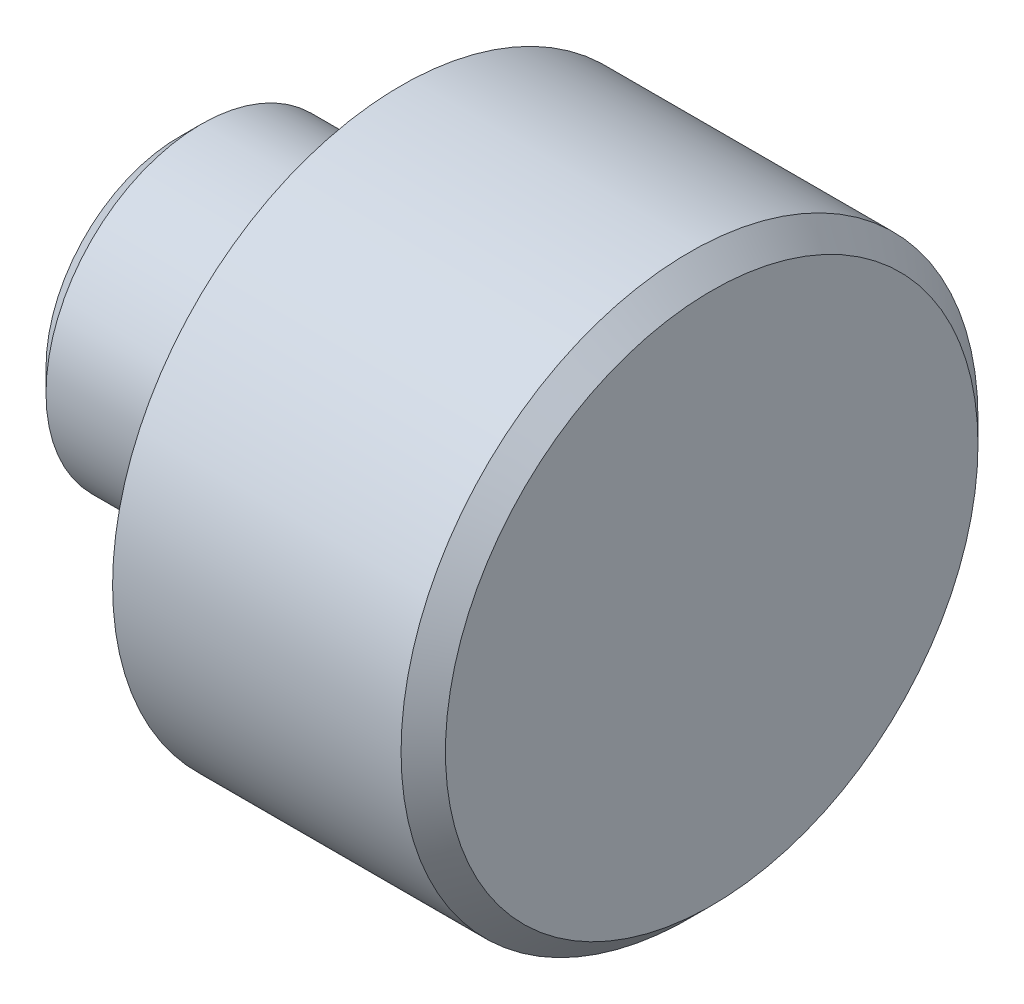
from build123d import *

# Parameters (mm, degrees)
ESQUISSE1_R          = 6.5
BASE_EXTRUSION_DEPTH = 7
ESQUISSE2_R          = 3.5
BOSS_EXTRU_1_DEPTH   = 5
CHANFREIN1_SIZE      = 0.5


with BuildPart() as part:
    # Esquisse1 → Base-Extrusion (new body)
    with BuildSketch(Plane(origin=(0, 0, 0), x_dir=(0, 0, -1), z_dir=(1, 0, 0))):
        Circle(ESQUISSE1_R)
    extrude(amount=BASE_EXTRUSION_DEPTH)

    # Esquisse2 → Boss.-Extru.1 (add)
    with BuildSketch(Plane.ZY):
        with Locations(Location((0, 0, 0), (0, 0, 180))):
            Circle(ESQUISSE2_R)
    extrude(amount=BOSS_EXTRU_1_DEPTH)

    # Chanfrein1
    chanfrein1_edges = [part.edges().sort_by_distance(p)[0] for p in [
        (7, 0, 6.5),
        (-5, 0, 3.5),
    ]]
    chamfer(chanfrein1_edges, length=CHANFREIN1_SIZE)


solid = part.part
